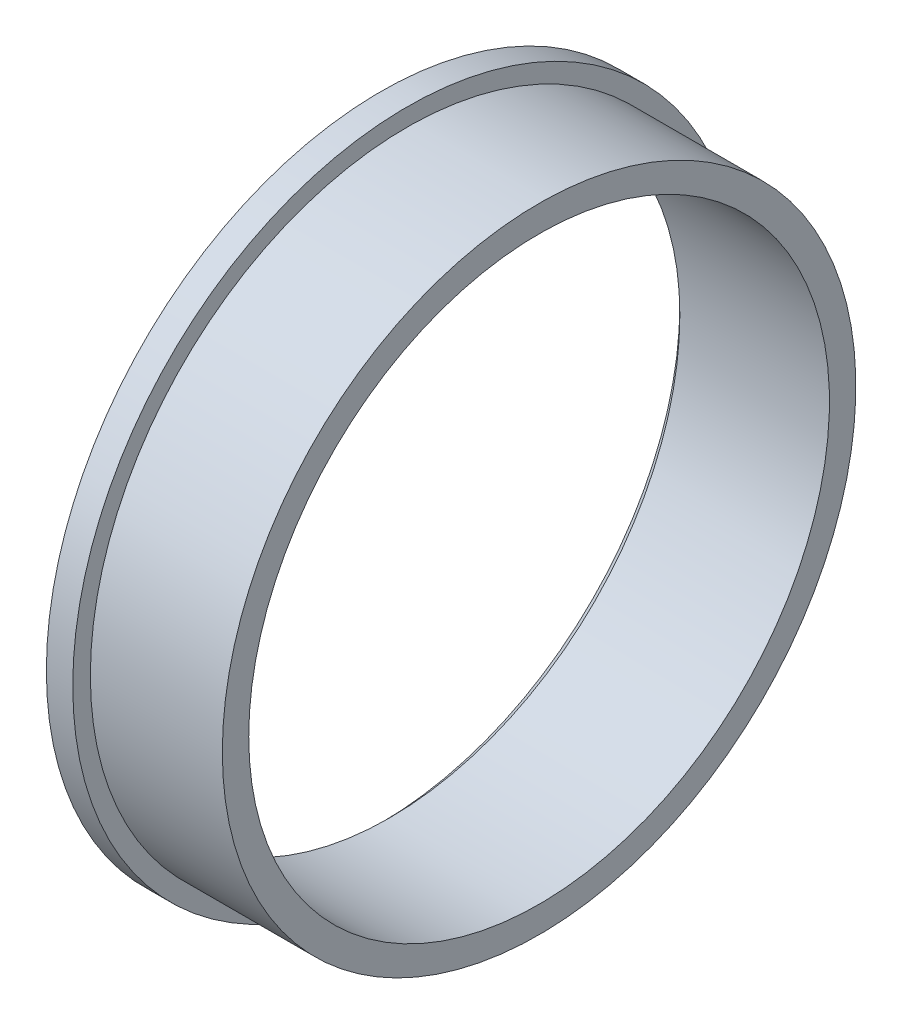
ISO-10303-21;
HEADER;
FILE_DESCRIPTION(('STEP AP214'),'2;1');
FILE_NAME('part.step','',(''),(''),'','','');
FILE_SCHEMA(('AUTOMOTIVE_DESIGN { 1 0 10303 214 1 1 1 1 }'));
ENDSEC;
DATA;
#1=APPLICATION_CONTEXT('core data for automotive mechanical design processes');
#2=APPLICATION_PROTOCOL_DEFINITION('international standard','automotive_design',2000,#1);
#3=PRODUCT_CONTEXT('',#1,'mechanical');
#4=PRODUCT('Part','Part','',(#3));
#5=PRODUCT_RELATED_PRODUCT_CATEGORY('part','',(#4));
#6=PRODUCT_DEFINITION_FORMATION('','',#4);
#7=PRODUCT_DEFINITION_CONTEXT('part definition',#1,'design');
#8=PRODUCT_DEFINITION('design','',#6,#7);
#9=PRODUCT_DEFINITION_SHAPE('','',#8);
#10=(LENGTH_UNIT() NAMED_UNIT(*) SI_UNIT(.MILLI.,.METRE.));
#11=(NAMED_UNIT(*) PLANE_ANGLE_UNIT() SI_UNIT($,.RADIAN.));
#12=(NAMED_UNIT(*) SI_UNIT($,.STERADIAN.) SOLID_ANGLE_UNIT());
#13=UNCERTAINTY_MEASURE_WITH_UNIT(LENGTH_MEASURE(1.E-05),#10,'distance_accuracy_value','');
#14=(GEOMETRIC_REPRESENTATION_CONTEXT(3) GLOBAL_UNCERTAINTY_ASSIGNED_CONTEXT((#13)) GLOBAL_UNIT_ASSIGNED_CONTEXT((#10,
#11,#12)) REPRESENTATION_CONTEXT('',''));
#15=CARTESIAN_POINT('',(0.,0.,0.));
#16=DIRECTION('',(0.,0.,1.));
#17=DIRECTION('',(1.,0.,0.));
#18=AXIS2_PLACEMENT_3D('',#15,#16,#17);
#19=CARTESIAN_POINT('',(-16.572815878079,0.,0.));
#20=DIRECTION('',(-1.,0.,0.));
#21=DIRECTION('',(0.,0.,1.));
#22=AXIS2_PLACEMENT_3D('',#19,#20,#21);
#23=CYLINDRICAL_SURFACE('',#22,19.);
#24=CARTESIAN_POINT('',(0.,0.,0.));
#25=DIRECTION('',(-1.,0.,0.));
#26=DIRECTION('',(0.,0.,1.));
#27=AXIS2_PLACEMENT_3D('',#24,#25,#26);
#28=CIRCLE('',#27,19.);
#29=CARTESIAN_POINT('',(0.,0.,19.));
#30=VERTEX_POINT('',#29);
#31=EDGE_CURVE('E55',#30,#30,#28,.T.);
#32=ORIENTED_EDGE('',*,*,#31,.F.);
#33=EDGE_LOOP('',(#32));
#34=FACE_BOUND('',#33,.T.);
#35=CARTESIAN_POINT('',(1.5,0.,0.));
#36=DIRECTION('',(-1.,0.,0.));
#37=DIRECTION('',(0.,0.,1.));
#38=AXIS2_PLACEMENT_3D('',#35,#36,#37);
#39=CIRCLE('',#38,19.);
#40=CARTESIAN_POINT('',(1.5,0.,19.));
#41=VERTEX_POINT('',#40);
#42=EDGE_CURVE('E40',#41,#41,#39,.T.);
#43=ORIENTED_EDGE('',*,*,#42,.T.);
#44=EDGE_LOOP('',(#43));
#45=FACE_BOUND('',#44,.T.);
#46=ADVANCED_FACE('F29',(#34,#45),#23,.T.);
#47=CARTESIAN_POINT('',(1.5,18.,0.));
#48=DIRECTION('',(-1.,0.,0.));
#49=DIRECTION('',(0.,0.,1.));
#50=AXIS2_PLACEMENT_3D('',#47,#48,#49);
#51=PLANE('',#50);
#52=ORIENTED_EDGE('',*,*,#42,.F.);
#53=EDGE_LOOP('',(#52));
#54=FACE_BOUND('',#53,.T.);
#55=CARTESIAN_POINT('',(1.5,0.,0.));
#56=DIRECTION('',(-1.,0.,0.));
#57=DIRECTION('',(0.,0.,1.));
#58=AXIS2_PLACEMENT_3D('',#55,#56,#57);
#59=CIRCLE('',#58,18.);
#60=CARTESIAN_POINT('',(1.5,0.,18.));
#61=VERTEX_POINT('',#60);
#62=EDGE_CURVE('E44',#61,#61,#59,.T.);
#63=ORIENTED_EDGE('',*,*,#62,.T.);
#64=EDGE_LOOP('',(#63));
#65=FACE_BOUND('',#64,.T.);
#66=ADVANCED_FACE('F63',(#54,#65),#51,.F.);
#67=CARTESIAN_POINT('',(-16.572815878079,0.,0.));
#68=DIRECTION('',(-1.,0.,0.));
#69=DIRECTION('',(0.,0.,1.));
#70=AXIS2_PLACEMENT_3D('',#67,#68,#69);
#71=CYLINDRICAL_SURFACE('',#70,18.);
#72=ORIENTED_EDGE('',*,*,#62,.F.);
#73=EDGE_LOOP('',(#72));
#74=FACE_BOUND('',#73,.T.);
#75=CARTESIAN_POINT('',(9.,0.,0.));
#76=DIRECTION('',(-1.,0.,0.));
#77=DIRECTION('',(0.,0.,1.));
#78=AXIS2_PLACEMENT_3D('',#75,#76,#77);
#79=CIRCLE('',#78,18.);
#80=CARTESIAN_POINT('',(9.,0.,18.));
#81=VERTEX_POINT('',#80);
#82=EDGE_CURVE('E49',#81,#81,#79,.T.);
#83=ORIENTED_EDGE('',*,*,#82,.T.);
#84=EDGE_LOOP('',(#83));
#85=FACE_BOUND('',#84,.T.);
#86=ADVANCED_FACE('F68',(#74,#85),#71,.T.);
#87=CARTESIAN_POINT('',(9.,16.5,0.));
#88=DIRECTION('',(-1.,0.,0.));
#89=DIRECTION('',(0.,0.,1.));
#90=AXIS2_PLACEMENT_3D('',#87,#88,#89);
#91=PLANE('',#90);
#92=ORIENTED_EDGE('',*,*,#82,.F.);
#93=EDGE_LOOP('',(#92));
#94=FACE_BOUND('',#93,.T.);
#95=CARTESIAN_POINT('',(9.,0.,0.));
#96=DIRECTION('',(-1.,0.,0.));
#97=DIRECTION('',(0.,0.,1.));
#98=AXIS2_PLACEMENT_3D('',#95,#96,#97);
#99=CIRCLE('',#98,16.5);
#100=CARTESIAN_POINT('',(9.,0.,16.5));
#101=VERTEX_POINT('',#100);
#102=EDGE_CURVE('E52',#101,#101,#99,.T.);
#103=ORIENTED_EDGE('',*,*,#102,.T.);
#104=EDGE_LOOP('',(#103));
#105=FACE_BOUND('',#104,.T.);
#106=ADVANCED_FACE('F74',(#94,#105),#91,.F.);
#107=CARTESIAN_POINT('',(-16.572815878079,0.,0.));
#108=DIRECTION('',(-1.,0.,0.));
#109=DIRECTION('',(0.,0.,1.));
#110=AXIS2_PLACEMENT_3D('',#107,#108,#109);
#111=CYLINDRICAL_SURFACE('',#110,16.5);
#112=CARTESIAN_POINT('',(0.5,0.,0.));
#113=DIRECTION('',(1.,0.,0.));
#114=DIRECTION('',(0.,0.,-1.));
#115=AXIS2_PLACEMENT_3D('',#112,#113,#114);
#116=CIRCLE('',#115,16.5);
#117=CARTESIAN_POINT('',(0.5,0.,-16.5));
#118=VERTEX_POINT('',#117);
#119=EDGE_CURVE('E36',#118,#118,#116,.F.);
#120=ORIENTED_EDGE('',*,*,#119,.T.);
#121=EDGE_LOOP('',(#120));
#122=FACE_BOUND('',#121,.T.);
#123=ORIENTED_EDGE('',*,*,#102,.F.);
#124=EDGE_LOOP('',(#123));
#125=FACE_BOUND('',#124,.T.);
#126=ADVANCED_FACE('F80',(#122,#125),#111,.F.);
#127=CARTESIAN_POINT('',(0.,19.,0.));
#128=DIRECTION('',(1.,0.,0.));
#129=DIRECTION('',(0.,0.,-1.));
#130=AXIS2_PLACEMENT_3D('',#127,#128,#129);
#131=PLANE('',#130);
#132=CARTESIAN_POINT('',(0.,0.,0.));
#133=DIRECTION('',(1.,0.,0.));
#134=DIRECTION('',(0.,0.,-1.));
#135=AXIS2_PLACEMENT_3D('',#132,#133,#134);
#136=CIRCLE('',#135,17.);
#137=CARTESIAN_POINT('',(0.,0.,-17.));
#138=VERTEX_POINT('',#137);
#139=EDGE_CURVE('E10',#138,#138,#136,.T.);
#140=ORIENTED_EDGE('',*,*,#139,.T.);
#141=EDGE_LOOP('',(#140));
#142=FACE_BOUND('',#141,.T.);
#143=ORIENTED_EDGE('',*,*,#31,.T.);
#144=EDGE_LOOP('',(#143));
#145=FACE_BOUND('',#144,.T.);
#146=ADVANCED_FACE('F59',(#142,#145),#131,.F.);
#147=CARTESIAN_POINT('',(0.5,0.,0.));
#148=DIRECTION('',(-1.,0.,0.));
#149=DIRECTION('',(0.,0.,1.));
#150=AXIS2_PLACEMENT_3D('',#147,#148,#149);
#151=CONICAL_SURFACE('',#150,16.5,0.785398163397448);
#152=ORIENTED_EDGE('',*,*,#139,.F.);
#153=EDGE_LOOP('',(#152));
#154=FACE_BOUND('',#153,.T.);
#155=ORIENTED_EDGE('',*,*,#119,.F.);
#156=EDGE_LOOP('',(#155));
#157=FACE_BOUND('',#156,.T.);
#158=ADVANCED_FACE('F31',(#154,#157),#151,.F.);
#159=CLOSED_SHELL('',(#46,#66,#86,#106,#126,#146,#158));
#160=MANIFOLD_SOLID_BREP('B2',#159);
#161=ADVANCED_BREP_SHAPE_REPRESENTATION('',(#18,#160),#14);
#162=SHAPE_DEFINITION_REPRESENTATION(#9,#161);
ENDSEC;
END-ISO-10303-21;
